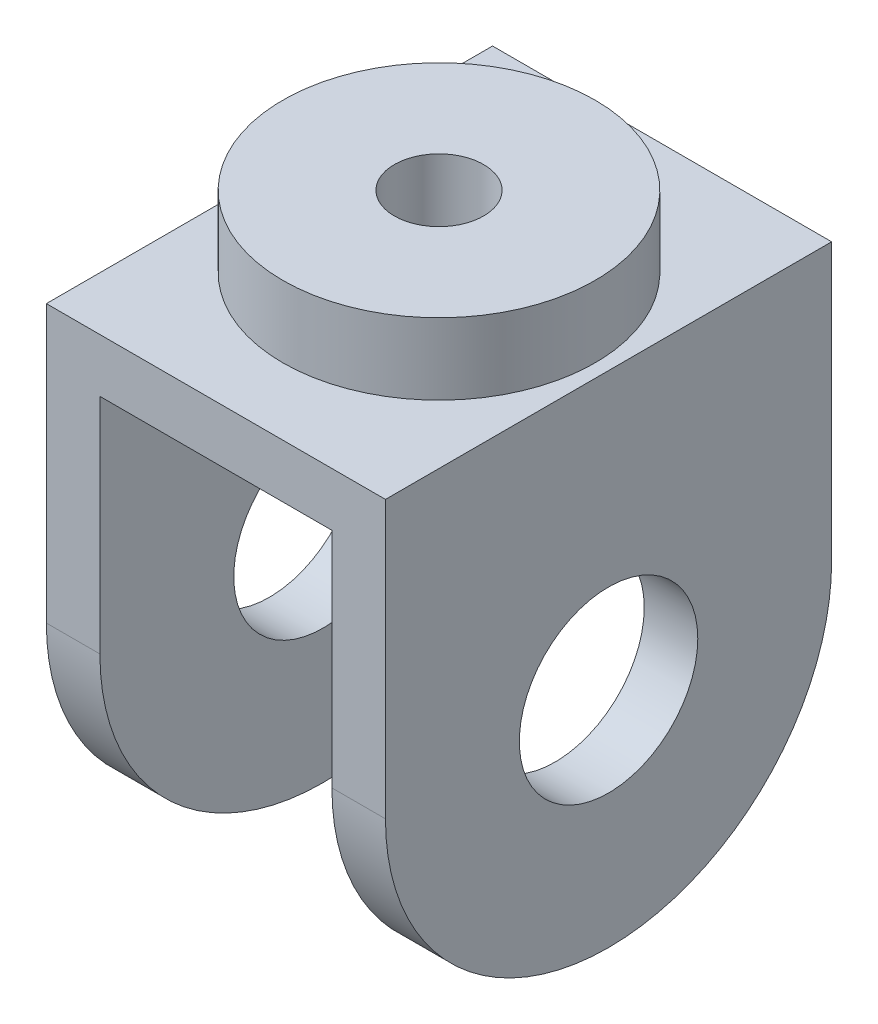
from build123d import *

# Parameters (mm, degrees)
SKETCH1_R           = 10
BOSS_EXTRUDE1_DEPTH = 6
SKETCH2_W           = 38
SKETCH2_H           = 50
BOSS_EXTRUDE2_DEPTH = 6
SKETCH3_R           = 17.5
BOSS_EXTRUDE3_DEPTH = 8
SKETCH4_R           = 5
CUT_EXTRUDE1_DEPTH  = 76.795778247


with BuildPart() as part:
    # Sketch1 → Boss-Extrude1 (new body)
    with BuildSketch(Plane(origin=(0, 0, 0), x_dir=(0, 0, -1), z_dir=(1, 0, 0))):
        with BuildLine():
            Line((-25, 0), (-25, 25))
            Line((-25, 25), (25, 25))
            Line((25, 25), (25, 0))
            ThreePointArc((25, 0), (0, -25), (-25, 0))
        make_face()
        Circle(SKETCH1_R, mode=Mode.SUBTRACT)
    boss_extrude1 = extrude(amount=BOSS_EXTRUDE1_DEPTH)

    # Sketch2 → Boss-Extrude2 (add)
    with BuildSketch(Plane(origin=(0, 25, 0), x_dir=(1, 0, 0), z_dir=(0, 1, 0))):
        with Locations((-13, 0)):
            Rectangle(SKETCH2_W, SKETCH2_H)
    extrude(amount=BOSS_EXTRUDE2_DEPTH)

    # Sketch3 → Boss-Extrude3 (add)
    with BuildSketch(Plane(origin=(0, 31, 0), x_dir=(1, 0, 0), z_dir=(0, 1, 0))):
        with Locations(Location((-13, 0, 0), (0, 0, 270))):
            Circle(SKETCH3_R)
    extrude(amount=BOSS_EXTRUDE3_DEPTH)

    # Sketch4 → Cut-Extrude1 (cut, through all)
    with BuildSketch(Plane(origin=(0, 39, 0), x_dir=(1, 0, 0), z_dir=(0, 1, 0))):
        with Locations(Location((-13, 0, 0), (0, 0, 270))):
            Circle(SKETCH4_R)
    extrude(amount=-CUT_EXTRUDE1_DEPTH, mode=Mode.SUBTRACT)

    # Mirror1: Boss-Extrude1 across plane
    add(boss_extrude1.mirror(Plane(origin=(-13, 0, 0), x_dir=(0, 0, 1), z_dir=(1, 0, 0))))


solid = part.part
